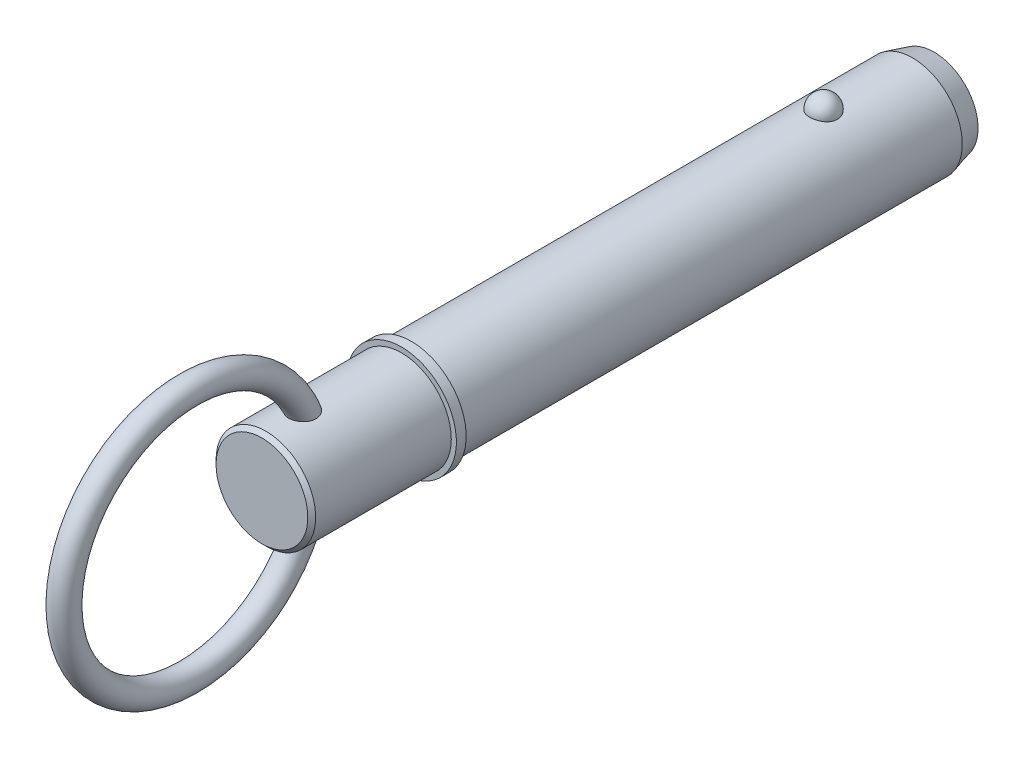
from build123d import *

# Parameters (mm, degrees)
SKETCH2_R           = 12.7
BOSS_EXTRUDE1_DEPTH = 101.6
BOSS_EXTRUDE2_START = 31.75
SKETCH3_R           = 12.7
BOSS_EXTRUDE2_DEPTH = 31.75
CHAMFER1_SIZE       = 5.5
CHAMFER1_SIZE2      = 1.473720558
SKETCH20_W          = 2.5
SKETCH20_H          = 14
SKETCH21_R          = 12.7
BOSS_EXTRUDE3_DEPTH = 38.1
CHAMFER2_SIZE       = 1
SKETCH24_R          = 3.25


with BuildPart() as part:
    # Sketch2 → Boss-Extrude1 (new body)
    with BuildSketch(Plane.XY):
        Circle(SKETCH2_R)
    extrude(amount=BOSS_EXTRUDE1_DEPTH)

    # Sketch3 → Boss-Extrude2 (add)
    with BuildSketch(Plane(origin=(0, 0, 0), x_dir=(-1, 0, 0), z_dir=(0, 0, -1)).offset(BOSS_EXTRUDE2_START)):
        Circle(SKETCH3_R)
    extrude(amount=-BOSS_EXTRUDE2_DEPTH)

    # Chamfer1
    chamfer1_edges = [part.edges().sort_by_distance(p)[0] for p in [
        (12.7, 0, -31.75),
    ]]
    chamfer1_side = [part.faces().sort_by_distance(p)[0] for p in [
        (12.7, 0, -15.875),
    ]]
    chamfer(chamfer1_edges, length=CHAMFER1_SIZE, length2=CHAMFER1_SIZE2, reference=chamfer1_side[0])

    # Sketch18 → Revolve1 (revolve)
    with BuildSketch(Plane(origin=(0, 0, 0), x_dir=(0, 0, -1), z_dir=(1, 0, 0))):
        with BuildLine():
            Line((3.56, 16.26), (3.56, 9.14))
            ThreePointArc((3.56, 9.14), (0, 12.7), (3.56, 16.26))
        make_face()
    revolve(axis=Axis((0, 16.26, -3.56), (0, -1, 0)))

    # Sketch20 → Revolve2 (revolve)
    with BuildSketch(Plane(origin=(0, 0, 0), x_dir=(0, 0, -1), z_dir=(1, 0, 0)), mode=Mode.PRIVATE) as revolve2_sk:
        with Locations((-102.85, 7)):
            Rectangle(SKETCH20_W, SKETCH20_H)
    revolve(revolve2_sk.sketch.rotate(Axis((0, 0, 33.728787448), (0, 0, 1)), 90), axis=Axis((0, 0, 33.728787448), (0, 0, 1)))

    # Sketch21 → Boss-Extrude3 (add)
    with BuildSketch(Plane(origin=(0, 0, 101.6), x_dir=(-1, 0, 0), z_dir=(0, 0, -1))):
        Circle(SKETCH21_R)
    extrude(amount=-BOSS_EXTRUDE3_DEPTH)

    # Chamfer2
    chamfer2_edges = [part.edges().sort_by_distance(p)[0] for p in [
        (12.7, 0, 139.7),
    ]]
    chamfer(chamfer2_edges, length=CHAMFER2_SIZE)

    # Sweep1: sweep along a path in Sketch23
    with BuildLine(Plane(origin=(0, 0, 0), x_dir=(0, 0, -1), z_dir=(1, 0, 0))) as sweep1_path:
        CenterArc((-158.45, 0), 31.75, 0, 360)
    # Sketch24 → Sweep1 (sweep)
    with BuildSketch(Plane(origin=(0, 0, 0), x_dir=(1, 0, 0), z_dir=(0, 1, 0))):
        with Locations((0, -126.7)):
            Circle(SKETCH24_R)
    sweep(path=sweep1_path.line)


solid = part.part
